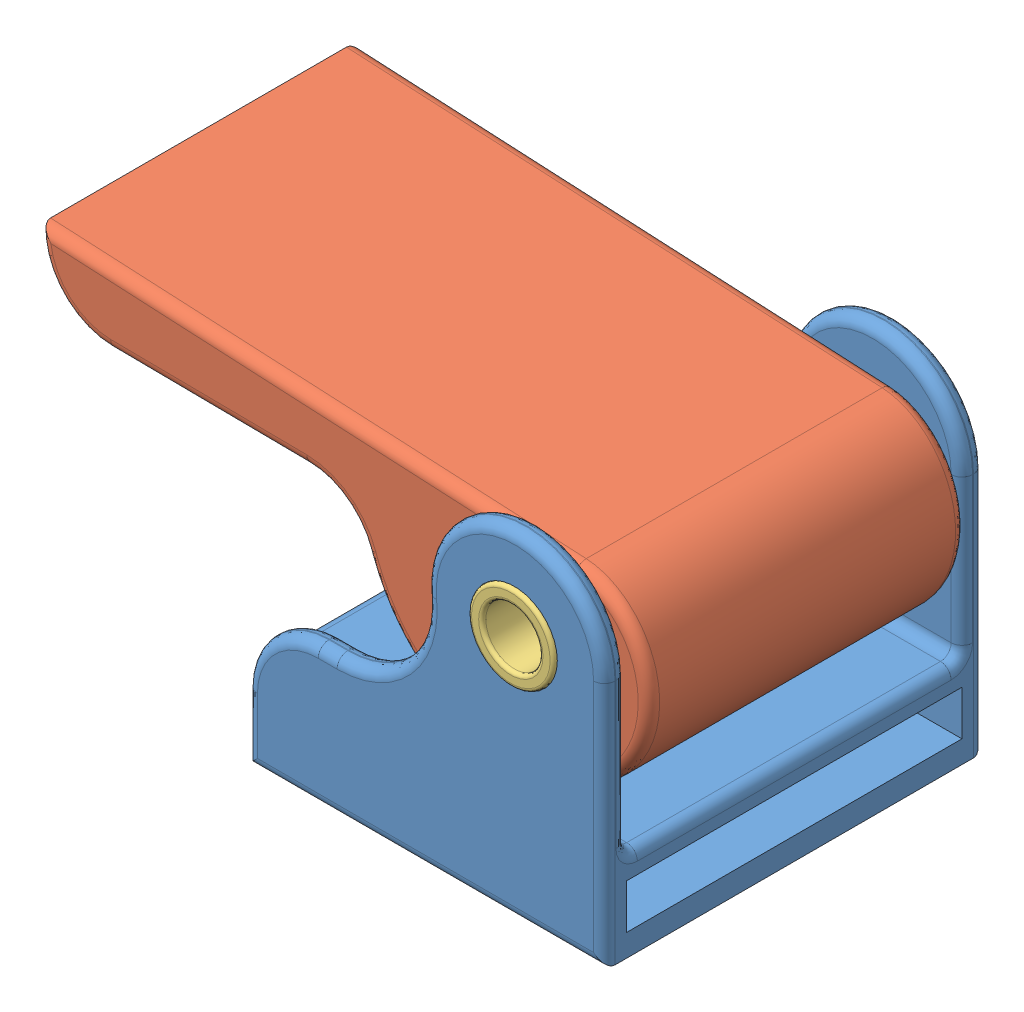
SolidWorks assembly Clasp assembly_&.SLDASM, configuration Default (file format 5000). Lengths in mm.
Overall size (47.96 32.78 27.57).
3 component instances, 3 part files, 4 mates.
Components (placement in the parent):
- Clasp-1_&-1: Clasp-1_&.SLDPRT [Default] at origin size (25.4 23.81 26.99)
- Clasp-2a_&-1: Clasp-2a_&.SLDPRT [Default] at (-6.35 12.7 0) x (0.961736 -0.273977 0) z (0 0 1) size (44.97 17.22 22.68)
- Clasp-pin_&-1: Clasp-pin_&.SLDPRT [Default] at (-6.35 12.7 0) x (0 0 1) z (-1 0 0) size (27.57 6.1 6.1)
Mates (geometry in assembly coordinates):
- Concentric2: concentric aligned: cylinder of Clasp-1_&-1 through (-6.35 12.7 -13.4938) axis (0 0 1) radius 2.3876; cylinder of Clasp-2a_&-1 through (-6.35 12.7 -11.2713) axis (0 0 1) radius 2.3876
- Coincident2: coincident aligned: plane of Clasp-1_&-1; plane of Clasp-2a_&-1
- Concentric3: concentric anti-aligned: cylinder of Clasp-2a_&-1 through (-6.35 12.7 -11.2713) axis (0 0 1) radius 2.3876; cylinder of Clasp-pin_&-1 through (-6.35 12.7 13.5319) axis (0 0 -1) radius 2.286
- Coincident3: coincident aligned: plane of Clasp-2a_&-1; plane of Clasp-pin_&-1
